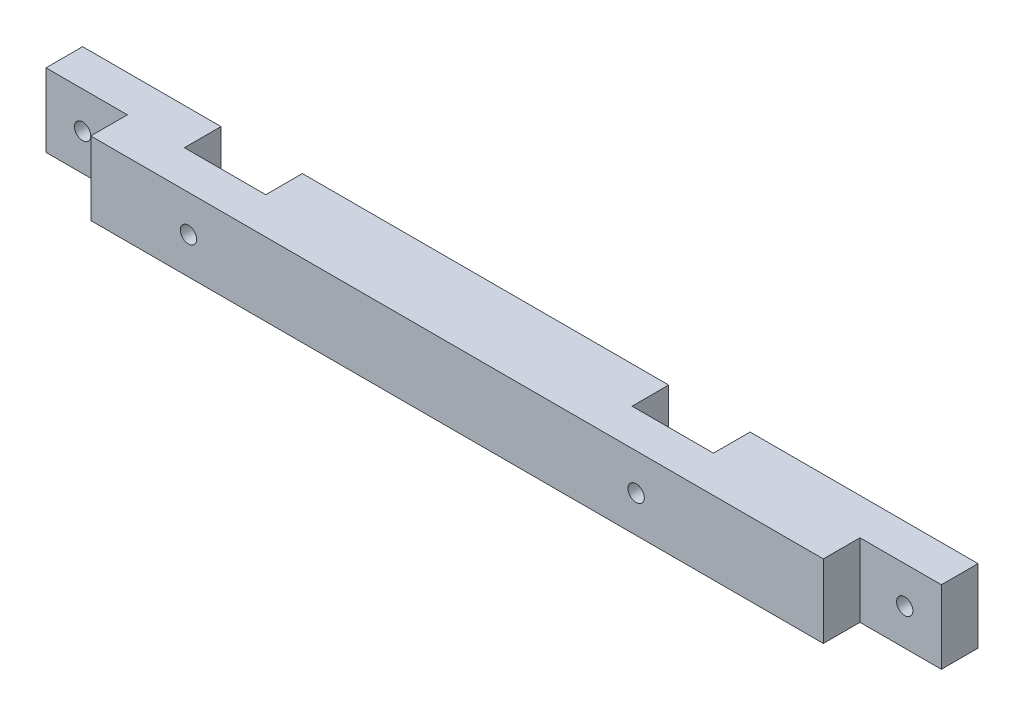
from build123d import *

# Parameters (mm, degrees)
ESQUISSE1_W             = 110
ESQUISSE1_H             = 9
EXTRUSION1_DEPTH        = 9
ESQUISSE2_W             = 10
ESQUISSE2_H             = 9
ENL_V_MAT_EXTRU_1_DEPTH = 4.5
ESQUISSE4_R             = 1
ENL_V_MAT_EXTRU_2_DEPTH = 4.5
ESQUISSE5_R             = 1
ENL_V_MAT_EXTRU_3_DEPTH = 4.5
ESQUISSE6_W             = 10
ESQUISSE6_H             = 9
ENL_V_MAT_EXTRU_4_DEPTH = 4.5
ESQUISSE7_R             = 1
ENL_V_MAT_EXTRU_5_DEPTH = 4.5


with BuildPart() as part:
    # Esquisse1 → Extrusion1 (new body)
    with BuildSketch(Plane.XY):
        with Locations((-12.271684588, -105.117562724)):
            Rectangle(ESQUISSE1_W, ESQUISSE1_H)
    extrude(amount=EXTRUSION1_DEPTH)

    # Esquisse2 → Enl_v. mat.-Extru.1 (cut)
    with BuildSketch(Plane.XY.offset(9)):
        with Locations((-62.271684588, -105.117562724)):
            Rectangle(ESQUISSE2_W, ESQUISSE2_H)
        with Locations((37.728315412, -105.117562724)):
            Rectangle(ESQUISSE2_W, ESQUISSE2_H)
    extrude(amount=-ENL_V_MAT_EXTRU_1_DEPTH, mode=Mode.SUBTRACT)

    # Esquisse4 → Enl_v. mat.-Extru.2 (cut)
    with BuildSketch(Plane.XY.offset(4.5)):
        with Locations((38.22840174, -105.145436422)):
            Circle(ESQUISSE4_R)
    extrude(amount=-ENL_V_MAT_EXTRU_2_DEPTH, mode=Mode.SUBTRACT)

    # Esquisse5 → Enl_v. mat.-Extru.3 (cut)
    with BuildSketch(Plane.XY.offset(4.5)):
        with Locations((-62.771684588, -105.117562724)):
            Circle(ESQUISSE5_R)
    extrude(amount=-ENL_V_MAT_EXTRU_3_DEPTH, mode=Mode.SUBTRACT)

    # Esquisse6 → Enl_v. mat.-Extru.4 (cut)
    with BuildSketch(Plane(origin=(0, 0, 0), x_dir=(-1, 0, 0), z_dir=(0, 0, -1))):
        with Locations((45.271684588, -105.117562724)):
            Rectangle(ESQUISSE6_W, ESQUISSE6_H)
        with Locations((-9.728315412, -105.117562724)):
            Rectangle(ESQUISSE6_W, ESQUISSE6_H)
    extrude(amount=-ENL_V_MAT_EXTRU_4_DEPTH, mode=Mode.SUBTRACT)

    # Esquisse7 → Enl_v. mat.-Extru.5 (cut)
    with BuildSketch(Plane(origin=(0, 0, 4.5), x_dir=(-1, 0, 0), z_dir=(0, 0, -1))):
        with Locations((45.271684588, -105.117562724)):
            Circle(ESQUISSE7_R)
        with Locations((-9.728315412, -105.117562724)):
            Circle(ESQUISSE7_R)
    extrude(amount=-ENL_V_MAT_EXTRU_5_DEPTH, mode=Mode.SUBTRACT)


solid = part.part
